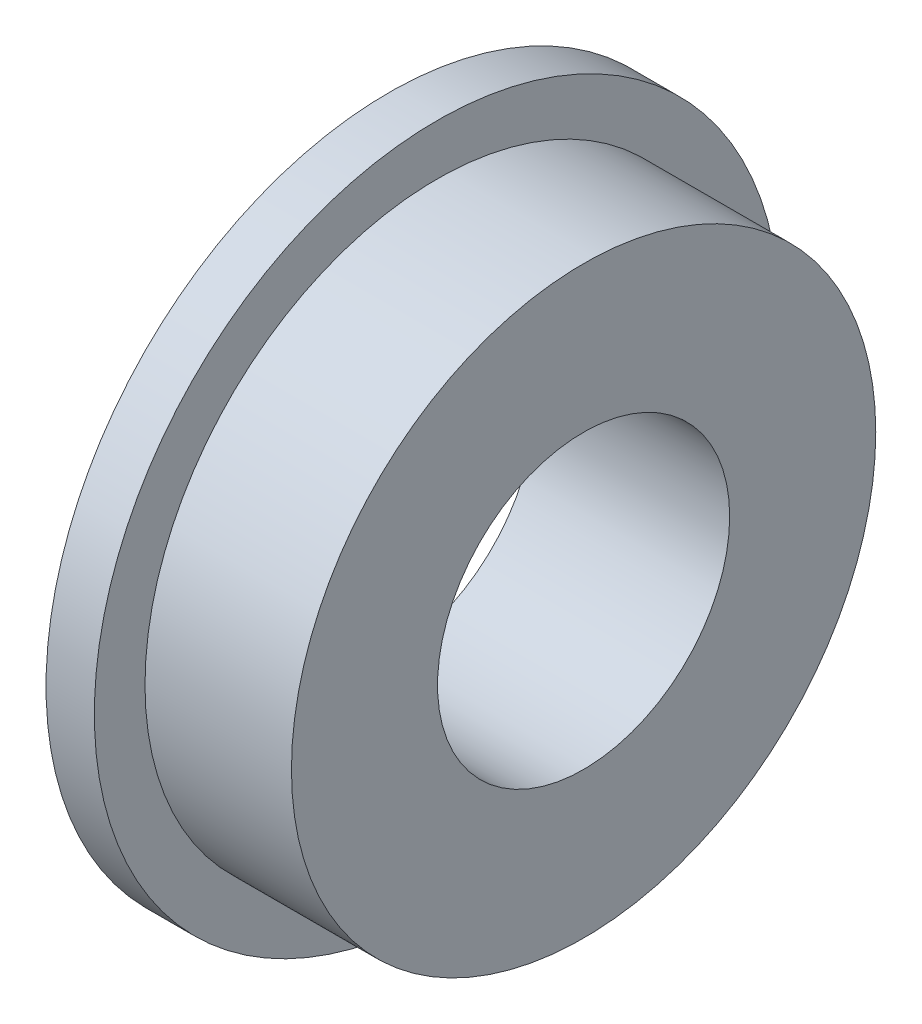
ISO-10303-21;
HEADER;
FILE_DESCRIPTION(('STEP AP214'),'2;1');
FILE_NAME('part.step','',(''),(''),'','','');
FILE_SCHEMA(('AUTOMOTIVE_DESIGN { 1 0 10303 214 1 1 1 1 }'));
ENDSEC;
DATA;
#1=APPLICATION_CONTEXT('core data for automotive mechanical design processes');
#2=APPLICATION_PROTOCOL_DEFINITION('international standard','automotive_design',2000,#1);
#3=PRODUCT_CONTEXT('',#1,'mechanical');
#4=PRODUCT('Part','Part','',(#3));
#5=PRODUCT_RELATED_PRODUCT_CATEGORY('part','',(#4));
#6=PRODUCT_DEFINITION_FORMATION('','',#4);
#7=PRODUCT_DEFINITION_CONTEXT('part definition',#1,'design');
#8=PRODUCT_DEFINITION('design','',#6,#7);
#9=PRODUCT_DEFINITION_SHAPE('','',#8);
#10=(LENGTH_UNIT() NAMED_UNIT(*) SI_UNIT(.MILLI.,.METRE.));
#11=(NAMED_UNIT(*) PLANE_ANGLE_UNIT() SI_UNIT($,.RADIAN.));
#12=(NAMED_UNIT(*) SI_UNIT($,.STERADIAN.) SOLID_ANGLE_UNIT());
#13=UNCERTAINTY_MEASURE_WITH_UNIT(LENGTH_MEASURE(1.E-05),#10,'distance_accuracy_value','');
#14=(GEOMETRIC_REPRESENTATION_CONTEXT(3) GLOBAL_UNCERTAINTY_ASSIGNED_CONTEXT((#13)) GLOBAL_UNIT_ASSIGNED_CONTEXT((#10,
#11,#12)) REPRESENTATION_CONTEXT('',''));
#15=CARTESIAN_POINT('',(0.,0.,0.));
#16=DIRECTION('',(0.,0.,1.));
#17=DIRECTION('',(1.,0.,0.));
#18=AXIS2_PLACEMENT_3D('',#15,#16,#17);
#19=CARTESIAN_POINT('',(0.,0.,0.));
#20=DIRECTION('',(1.,0.,0.));
#21=DIRECTION('',(0.,0.,-1.));
#22=AXIS2_PLACEMENT_3D('',#19,#20,#21);
#23=CYLINDRICAL_SURFACE('',#22,2.38125);
#24=CARTESIAN_POINT('',(0.,0.,0.));
#25=DIRECTION('',(1.,0.,0.));
#26=DIRECTION('',(0.,0.,-1.));
#27=AXIS2_PLACEMENT_3D('',#24,#25,#26);
#28=CIRCLE('',#27,2.38125);
#29=CARTESIAN_POINT('',(0.,0.,-2.38125));
#30=VERTEX_POINT('',#29);
#31=EDGE_CURVE('E10',#30,#30,#28,.T.);
#32=ORIENTED_EDGE('',*,*,#31,.T.);
#33=EDGE_LOOP('',(#32));
#34=FACE_BOUND('',#33,.T.);
#35=CARTESIAN_POINT('',(-3.175,0.,0.));
#36=DIRECTION('',(1.,0.,0.));
#37=DIRECTION('',(0.,0.,-1.));
#38=AXIS2_PLACEMENT_3D('',#35,#36,#37);
#39=CIRCLE('',#38,2.38125);
#40=CARTESIAN_POINT('',(-3.175,0.,-2.38125));
#41=VERTEX_POINT('',#40);
#42=EDGE_CURVE('E49',#41,#41,#39,.T.);
#43=ORIENTED_EDGE('',*,*,#42,.F.);
#44=EDGE_LOOP('',(#43));
#45=FACE_BOUND('',#44,.T.);
#46=ADVANCED_FACE('F27',(#34,#45),#23,.F.);
#47=CARTESIAN_POINT('',(0.,2.38125,0.));
#48=DIRECTION('',(1.,0.,0.));
#49=DIRECTION('',(0.,0.,-1.));
#50=AXIS2_PLACEMENT_3D('',#47,#48,#49);
#51=PLANE('',#50);
#52=CARTESIAN_POINT('',(0.,0.,0.));
#53=DIRECTION('',(1.,0.,0.));
#54=DIRECTION('',(0.,0.,-1.));
#55=AXIS2_PLACEMENT_3D('',#52,#53,#54);
#56=CIRCLE('',#55,4.7625);
#57=CARTESIAN_POINT('',(0.,0.,-4.7625));
#58=VERTEX_POINT('',#57);
#59=EDGE_CURVE('E33',#58,#58,#56,.T.);
#60=ORIENTED_EDGE('',*,*,#59,.T.);
#61=EDGE_LOOP('',(#60));
#62=FACE_BOUND('',#61,.T.);
#63=ORIENTED_EDGE('',*,*,#31,.F.);
#64=EDGE_LOOP('',(#63));
#65=FACE_BOUND('',#64,.T.);
#66=ADVANCED_FACE('F57',(#62,#65),#51,.T.);
#67=CARTESIAN_POINT('',(0.,0.,0.));
#68=DIRECTION('',(1.,0.,0.));
#69=DIRECTION('',(0.,0.,-1.));
#70=AXIS2_PLACEMENT_3D('',#67,#68,#69);
#71=CYLINDRICAL_SURFACE('',#70,4.7625);
#72=CARTESIAN_POINT('',(-2.3876,0.,0.));
#73=DIRECTION('',(1.,0.,0.));
#74=DIRECTION('',(0.,0.,-1.));
#75=AXIS2_PLACEMENT_3D('',#72,#73,#74);
#76=CIRCLE('',#75,4.7625);
#77=CARTESIAN_POINT('',(-2.3876,0.,-4.7625));
#78=VERTEX_POINT('',#77);
#79=EDGE_CURVE('E37',#78,#78,#76,.T.);
#80=ORIENTED_EDGE('',*,*,#79,.T.);
#81=EDGE_LOOP('',(#80));
#82=FACE_BOUND('',#81,.T.);
#83=ORIENTED_EDGE('',*,*,#59,.F.);
#84=EDGE_LOOP('',(#83));
#85=FACE_BOUND('',#84,.T.);
#86=ADVANCED_FACE('F61',(#82,#85),#71,.T.);
#87=CARTESIAN_POINT('',(-2.3876,4.7625,0.));
#88=DIRECTION('',(1.,0.,0.));
#89=DIRECTION('',(0.,0.,-1.));
#90=AXIS2_PLACEMENT_3D('',#87,#88,#89);
#91=PLANE('',#90);
#92=CARTESIAN_POINT('',(-2.3876,0.,0.));
#93=DIRECTION('',(1.,0.,0.));
#94=DIRECTION('',(0.,0.,-1.));
#95=AXIS2_PLACEMENT_3D('',#92,#93,#94);
#96=CIRCLE('',#95,5.588);
#97=CARTESIAN_POINT('',(-2.3876,0.,-5.588));
#98=VERTEX_POINT('',#97);
#99=EDGE_CURVE('E41',#98,#98,#96,.T.);
#100=ORIENTED_EDGE('',*,*,#99,.T.);
#101=EDGE_LOOP('',(#100));
#102=FACE_BOUND('',#101,.T.);
#103=ORIENTED_EDGE('',*,*,#79,.F.);
#104=EDGE_LOOP('',(#103));
#105=FACE_BOUND('',#104,.T.);
#106=ADVANCED_FACE('F65',(#102,#105),#91,.T.);
#107=CARTESIAN_POINT('',(0.,0.,0.));
#108=DIRECTION('',(1.,0.,0.));
#109=DIRECTION('',(0.,0.,-1.));
#110=AXIS2_PLACEMENT_3D('',#107,#108,#109);
#111=CYLINDRICAL_SURFACE('',#110,5.588);
#112=CARTESIAN_POINT('',(-3.175,0.,0.));
#113=DIRECTION('',(1.,0.,0.));
#114=DIRECTION('',(0.,0.,-1.));
#115=AXIS2_PLACEMENT_3D('',#112,#113,#114);
#116=CIRCLE('',#115,5.588);
#117=CARTESIAN_POINT('',(-3.175,0.,-5.588));
#118=VERTEX_POINT('',#117);
#119=EDGE_CURVE('E46',#118,#118,#116,.T.);
#120=ORIENTED_EDGE('',*,*,#119,.T.);
#121=EDGE_LOOP('',(#120));
#122=FACE_BOUND('',#121,.T.);
#123=ORIENTED_EDGE('',*,*,#99,.F.);
#124=EDGE_LOOP('',(#123));
#125=FACE_BOUND('',#124,.T.);
#126=ADVANCED_FACE('F72',(#122,#125),#111,.T.);
#127=CARTESIAN_POINT('',(-3.175,5.588,0.));
#128=DIRECTION('',(-1.,0.,0.));
#129=DIRECTION('',(0.,0.,1.));
#130=AXIS2_PLACEMENT_3D('',#127,#128,#129);
#131=PLANE('',#130);
#132=ORIENTED_EDGE('',*,*,#42,.T.);
#133=EDGE_LOOP('',(#132));
#134=FACE_BOUND('',#133,.T.);
#135=ORIENTED_EDGE('',*,*,#119,.F.);
#136=EDGE_LOOP('',(#135));
#137=FACE_BOUND('',#136,.T.);
#138=ADVANCED_FACE('F53',(#134,#137),#131,.T.);
#139=CLOSED_SHELL('',(#46,#66,#86,#106,#126,#138));
#140=MANIFOLD_SOLID_BREP('B2',#139);
#141=ADVANCED_BREP_SHAPE_REPRESENTATION('',(#18,#140),#14);
#142=SHAPE_DEFINITION_REPRESENTATION(#9,#141);
ENDSEC;
END-ISO-10303-21;
